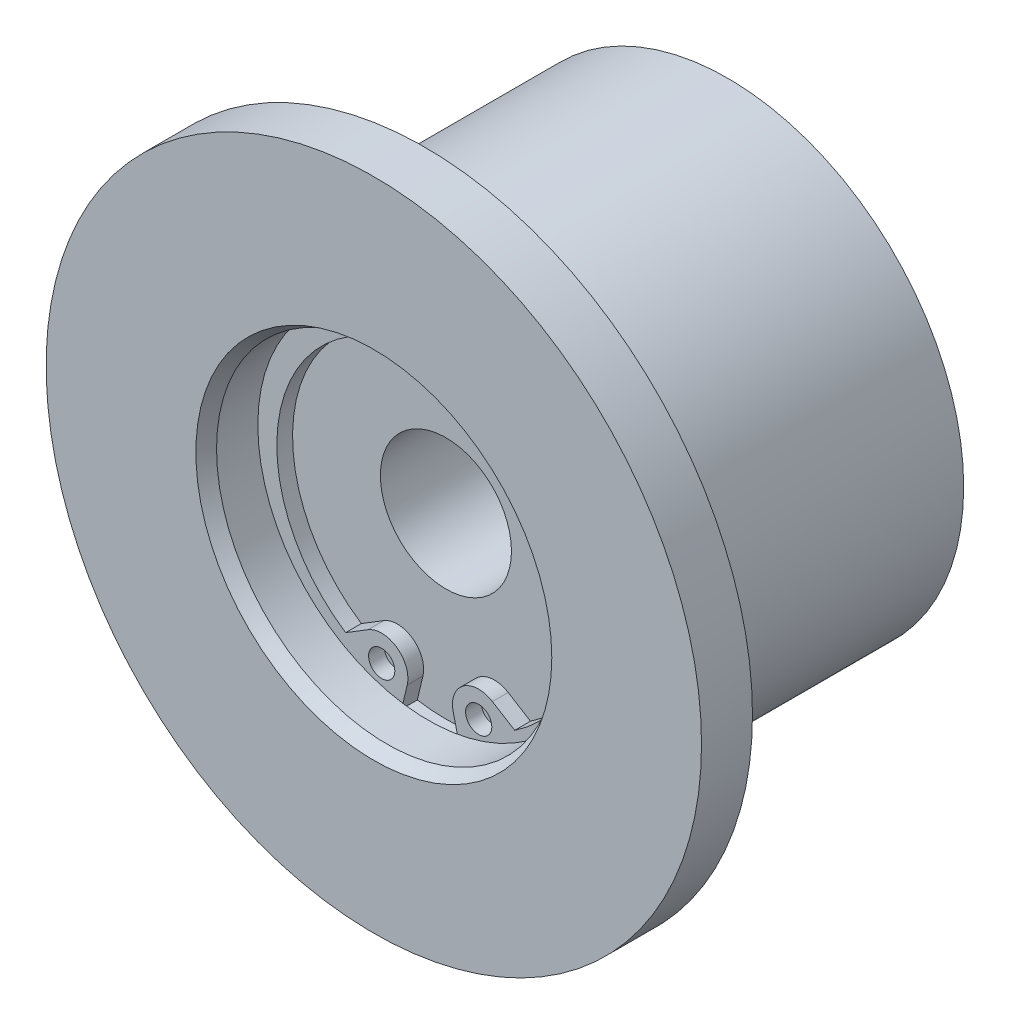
ISO-10303-21;
HEADER;
FILE_DESCRIPTION(('STEP AP214'),'2;1');
FILE_NAME('part.step','',(''),(''),'','','');
FILE_SCHEMA(('AUTOMOTIVE_DESIGN { 1 0 10303 214 1 1 1 1 }'));
ENDSEC;
DATA;
#1=APPLICATION_CONTEXT('core data for automotive mechanical design processes');
#2=APPLICATION_PROTOCOL_DEFINITION('international standard','automotive_design',2000,#1);
#3=PRODUCT_CONTEXT('',#1,'mechanical');
#4=PRODUCT('Part','Part','',(#3));
#5=PRODUCT_RELATED_PRODUCT_CATEGORY('part','',(#4));
#6=PRODUCT_DEFINITION_FORMATION('','',#4);
#7=PRODUCT_DEFINITION_CONTEXT('part definition',#1,'design');
#8=PRODUCT_DEFINITION('design','',#6,#7);
#9=PRODUCT_DEFINITION_SHAPE('','',#8);
#10=(LENGTH_UNIT() NAMED_UNIT(*) SI_UNIT(.MILLI.,.METRE.));
#11=(NAMED_UNIT(*) PLANE_ANGLE_UNIT() SI_UNIT($,.RADIAN.));
#12=(NAMED_UNIT(*) SI_UNIT($,.STERADIAN.) SOLID_ANGLE_UNIT());
#13=UNCERTAINTY_MEASURE_WITH_UNIT(LENGTH_MEASURE(1.E-05),#10,'distance_accuracy_value','');
#14=(GEOMETRIC_REPRESENTATION_CONTEXT(3) GLOBAL_UNCERTAINTY_ASSIGNED_CONTEXT((#13)) GLOBAL_UNIT_ASSIGNED_CONTEXT((#10,
#11,#12)) REPRESENTATION_CONTEXT('',''));
#15=CARTESIAN_POINT('',(0.,0.,0.));
#16=DIRECTION('',(0.,0.,1.));
#17=DIRECTION('',(1.,0.,0.));
#18=AXIS2_PLACEMENT_3D('',#15,#16,#17);
#19=CARTESIAN_POINT('',(0.,5.,8.));
#20=DIRECTION('',(0.,0.,-1.));
#21=DIRECTION('',(-1.,0.,0.));
#22=AXIS2_PLACEMENT_3D('',#19,#20,#21);
#23=PLANE('',#22);
#24=CARTESIAN_POINT('',(3.7,-11.165302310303,8.));
#25=DIRECTION('',(0.,0.,-1.));
#26=DIRECTION('',(-1.,0.,0.));
#27=AXIS2_PLACEMENT_3D('',#24,#25,#26);
#28=CIRCLE('',#27,1.);
#29=CARTESIAN_POINT('',(2.7,-11.165302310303,8.));
#30=VERTEX_POINT('',#29);
#31=EDGE_CURVE('E510',#30,#30,#28,.T.);
#32=ORIENTED_EDGE('',*,*,#31,.F.);
#33=EDGE_LOOP('',(#32));
#34=FACE_BOUND('',#33,.T.);
#35=ADVANCED_FACE('F14',(#34),#23,.F.);
#36=CARTESIAN_POINT('',(-3.7,-11.165302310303,8.));
#37=DIRECTION('',(0.,0.,-1.));
#38=DIRECTION('',(-1.,0.,0.));
#39=AXIS2_PLACEMENT_3D('',#36,#37,#38);
#40=CIRCLE('',#39,1.);
#41=CARTESIAN_POINT('',(-4.7,-11.165302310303,8.));
#42=VERTEX_POINT('',#41);
#43=EDGE_CURVE('E513',#42,#42,#40,.T.);
#44=ORIENTED_EDGE('',*,*,#43,.F.);
#45=EDGE_LOOP('',(#44));
#46=FACE_BOUND('',#45,.T.);
#47=ADVANCED_FACE('F298',(#46),#23,.F.);
#48=CARTESIAN_POINT('',(0.,0.,9.));
#49=DIRECTION('',(0.,0.,1.));
#50=DIRECTION('',(1.,0.,0.));
#51=AXIS2_PLACEMENT_3D('',#48,#49,#50);
#52=CONICAL_SURFACE('',#51,18.,1.48352986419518);
#53=CARTESIAN_POINT('',(0.,0.,9.61242064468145));
#54=DIRECTION('',(0.,0.,1.));
#55=DIRECTION('',(1.,0.,0.));
#56=AXIS2_PLACEMENT_3D('',#53,#54,#55);
#57=CIRCLE('',#56,25.);
#58=CARTESIAN_POINT('',(25.,0.,9.61242064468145));
#59=VERTEX_POINT('',#58);
#60=EDGE_CURVE('E504',#59,#59,#57,.T.);
#61=ORIENTED_EDGE('',*,*,#60,.F.);
#62=EDGE_LOOP('',(#61));
#63=FACE_BOUND('',#62,.T.);
#64=CARTESIAN_POINT('',(0.,0.,9.));
#65=DIRECTION('',(0.,0.,1.));
#66=DIRECTION('',(1.,0.,0.));
#67=AXIS2_PLACEMENT_3D('',#64,#65,#66);
#68=CIRCLE('',#67,18.);
#69=CARTESIAN_POINT('',(18.,0.,9.));
#70=VERTEX_POINT('',#69);
#71=EDGE_CURVE('E507',#70,#70,#68,.T.);
#72=ORIENTED_EDGE('',*,*,#71,.T.);
#73=EDGE_LOOP('',(#72));
#74=FACE_BOUND('',#73,.T.);
#75=ADVANCED_FACE('F317',(#63,#74),#52,.T.);
#76=CARTESIAN_POINT('',(0.,0.,18.1183293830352));
#77=DIRECTION('',(0.,0.,1.));
#78=DIRECTION('',(1.,0.,0.));
#79=AXIS2_PLACEMENT_3D('',#76,#77,#78);
#80=CYLINDRICAL_SURFACE('',#79,25.);
#81=CARTESIAN_POINT('',(0.,0.,13.5));
#82=DIRECTION('',(0.,0.,1.));
#83=DIRECTION('',(1.,0.,0.));
#84=AXIS2_PLACEMENT_3D('',#81,#82,#83);
#85=CIRCLE('',#84,25.);
#86=CARTESIAN_POINT('',(25.,0.,13.5));
#87=VERTEX_POINT('',#86);
#88=EDGE_CURVE('E501',#87,#87,#85,.T.);
#89=ORIENTED_EDGE('',*,*,#88,.F.);
#90=EDGE_LOOP('',(#89));
#91=FACE_BOUND('',#90,.T.);
#92=ORIENTED_EDGE('',*,*,#60,.T.);
#93=EDGE_LOOP('',(#92));
#94=FACE_BOUND('',#93,.T.);
#95=ADVANCED_FACE('F335',(#91,#94),#80,.T.);
#96=CARTESIAN_POINT('',(0.,0.,18.1183293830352));
#97=DIRECTION('',(0.,0.,1.));
#98=DIRECTION('',(1.,0.,0.));
#99=AXIS2_PLACEMENT_3D('',#96,#97,#98);
#100=CYLINDRICAL_SURFACE('',#99,18.);
#101=ORIENTED_EDGE('',*,*,#71,.F.);
#102=EDGE_LOOP('',(#101));
#103=FACE_BOUND('',#102,.T.);
#104=CARTESIAN_POINT('',(0.,0.,-13.5));
#105=DIRECTION('',(0.,0.,1.));
#106=DIRECTION('',(1.,0.,0.));
#107=AXIS2_PLACEMENT_3D('',#104,#105,#106);
#108=CIRCLE('',#107,18.);
#109=CARTESIAN_POINT('',(18.,0.,-13.5));
#110=VERTEX_POINT('',#109);
#111=EDGE_CURVE('E107',#110,#110,#108,.T.);
#112=ORIENTED_EDGE('',*,*,#111,.T.);
#113=EDGE_LOOP('',(#112));
#114=FACE_BOUND('',#113,.T.);
#115=ADVANCED_FACE('F329',(#103,#114),#100,.T.);
#116=CARTESIAN_POINT('',(0.,25.,13.5));
#117=DIRECTION('',(0.,0.,-1.));
#118=DIRECTION('',(-1.,0.,0.));
#119=AXIS2_PLACEMENT_3D('',#116,#117,#118);
#120=PLANE('',#119);
#121=CARTESIAN_POINT('',(0.,0.,13.5));
#122=DIRECTION('',(0.,0.,1.));
#123=DIRECTION('',(1.,0.,0.));
#124=AXIS2_PLACEMENT_3D('',#121,#122,#123);
#125=CIRCLE('',#124,13.5773502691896);
#126=CARTESIAN_POINT('',(13.5773502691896,0.,13.5));
#127=VERTEX_POINT('',#126);
#128=EDGE_CURVE('E498',#127,#127,#125,.T.);
#129=ORIENTED_EDGE('',*,*,#128,.F.);
#130=EDGE_LOOP('',(#129));
#131=FACE_BOUND('',#130,.T.);
#132=ORIENTED_EDGE('',*,*,#88,.T.);
#133=EDGE_LOOP('',(#132));
#134=FACE_BOUND('',#133,.T.);
#135=ADVANCED_FACE('F334',(#131,#134),#120,.F.);
#136=CARTESIAN_POINT('',(0.,11.,-13.5));
#137=DIRECTION('',(0.,0.,1.));
#138=DIRECTION('',(1.,0.,0.));
#139=AXIS2_PLACEMENT_3D('',#136,#137,#138);
#140=PLANE('',#139);
#141=ORIENTED_EDGE('',*,*,#111,.F.);
#142=EDGE_LOOP('',(#141));
#143=FACE_BOUND('',#142,.T.);
#144=CARTESIAN_POINT('',(0.,0.,-13.5));
#145=DIRECTION('',(0.,0.,1.));
#146=DIRECTION('',(1.,0.,0.));
#147=AXIS2_PLACEMENT_3D('',#144,#145,#146);
#148=CIRCLE('',#147,11.);
#149=CARTESIAN_POINT('',(11.,0.,-13.5));
#150=VERTEX_POINT('',#149);
#151=EDGE_CURVE('E473',#150,#150,#148,.T.);
#152=ORIENTED_EDGE('',*,*,#151,.T.);
#153=EDGE_LOOP('',(#152));
#154=FACE_BOUND('',#153,.T.);
#155=ADVANCED_FACE('F359',(#143,#154),#140,.F.);
#156=CARTESIAN_POINT('',(0.,0.,13.5));
#157=DIRECTION('',(0.,0.,1.));
#158=DIRECTION('',(1.,0.,0.));
#159=AXIS2_PLACEMENT_3D('',#156,#157,#158);
#160=CONICAL_SURFACE('',#159,13.5773502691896,0.523598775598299);
#161=CARTESIAN_POINT('',(0.,0.,12.5));
#162=DIRECTION('',(0.,0.,1.));
#163=DIRECTION('',(1.,0.,0.));
#164=AXIS2_PLACEMENT_3D('',#161,#162,#163);
#165=CIRCLE('',#164,13.);
#166=CARTESIAN_POINT('',(13.,0.,12.5));
#167=VERTEX_POINT('',#166);
#168=EDGE_CURVE('E495',#167,#167,#165,.T.);
#169=ORIENTED_EDGE('',*,*,#168,.F.);
#170=EDGE_LOOP('',(#169));
#171=FACE_BOUND('',#170,.T.);
#172=ORIENTED_EDGE('',*,*,#128,.T.);
#173=EDGE_LOOP('',(#172));
#174=FACE_BOUND('',#173,.T.);
#175=ADVANCED_FACE('F365',(#171,#174),#160,.F.);
#176=CARTESIAN_POINT('',(0.,0.,18.1183293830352));
#177=DIRECTION('',(0.,0.,1.));
#178=DIRECTION('',(1.,0.,0.));
#179=AXIS2_PLACEMENT_3D('',#176,#177,#178);
#180=CYLINDRICAL_SURFACE('',#179,11.);
#181=ORIENTED_EDGE('',*,*,#151,.F.);
#182=EDGE_LOOP('',(#181));
#183=FACE_BOUND('',#182,.T.);
#184=CARTESIAN_POINT('',(0.,0.,-8.));
#185=DIRECTION('',(0.,0.,1.));
#186=DIRECTION('',(1.,0.,0.));
#187=AXIS2_PLACEMENT_3D('',#184,#185,#186);
#188=CIRCLE('',#187,11.);
#189=CARTESIAN_POINT('',(11.,0.,-8.));
#190=VERTEX_POINT('',#189);
#191=EDGE_CURVE('E474',#190,#190,#188,.T.);
#192=ORIENTED_EDGE('',*,*,#191,.T.);
#193=EDGE_LOOP('',(#192));
#194=FACE_BOUND('',#193,.T.);
#195=ADVANCED_FACE('F370',(#183,#194),#180,.F.);
#196=CARTESIAN_POINT('',(0.,0.,18.1183293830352));
#197=DIRECTION('',(0.,0.,1.));
#198=DIRECTION('',(1.,0.,0.));
#199=AXIS2_PLACEMENT_3D('',#196,#197,#198);
#200=CYLINDRICAL_SURFACE('',#199,13.);
#201=CARTESIAN_POINT('',(0.,0.,9.35));
#202=DIRECTION('',(0.,0.,1.));
#203=DIRECTION('',(1.,0.,0.));
#204=AXIS2_PLACEMENT_3D('',#201,#202,#203);
#205=CIRCLE('',#204,13.);
#206=CARTESIAN_POINT('',(13.,0.,9.35));
#207=VERTEX_POINT('',#206);
#208=EDGE_CURVE('E492',#207,#207,#205,.T.);
#209=ORIENTED_EDGE('',*,*,#208,.F.);
#210=EDGE_LOOP('',(#209));
#211=FACE_BOUND('',#210,.T.);
#212=ORIENTED_EDGE('',*,*,#168,.T.);
#213=EDGE_LOOP('',(#212));
#214=FACE_BOUND('',#213,.T.);
#215=ADVANCED_FACE('F376',(#211,#214),#200,.F.);
#216=CARTESIAN_POINT('',(0.,11.,-8.));
#217=DIRECTION('',(0.,0.,1.));
#218=DIRECTION('',(1.,0.,0.));
#219=AXIS2_PLACEMENT_3D('',#216,#217,#218);
#220=PLANE('',#219);
#221=ORIENTED_EDGE('',*,*,#191,.F.);
#222=EDGE_LOOP('',(#221));
#223=FACE_BOUND('',#222,.T.);
#224=CARTESIAN_POINT('',(0.,0.,-8.));
#225=DIRECTION('',(0.,0.,1.));
#226=DIRECTION('',(1.,0.,0.));
#227=AXIS2_PLACEMENT_3D('',#224,#225,#226);
#228=CIRCLE('',#227,5.);
#229=CARTESIAN_POINT('',(5.,0.,-8.));
#230=VERTEX_POINT('',#229);
#231=EDGE_CURVE('E477',#230,#230,#228,.T.);
#232=ORIENTED_EDGE('',*,*,#231,.T.);
#233=EDGE_LOOP('',(#232));
#234=FACE_BOUND('',#233,.T.);
#235=ADVANCED_FACE('F381',(#223,#234),#220,.F.);
#236=CARTESIAN_POINT('',(0.,13.6,9.35));
#237=DIRECTION('',(0.,0.,1.));
#238=DIRECTION('',(1.,0.,0.));
#239=AXIS2_PLACEMENT_3D('',#236,#237,#238);
#240=PLANE('',#239);
#241=CARTESIAN_POINT('',(0.,0.,9.35));
#242=DIRECTION('',(0.,0.,1.));
#243=DIRECTION('',(1.,0.,0.));
#244=AXIS2_PLACEMENT_3D('',#241,#242,#243);
#245=CIRCLE('',#244,13.6);
#246=CARTESIAN_POINT('',(13.6,0.,9.35));
#247=VERTEX_POINT('',#246);
#248=EDGE_CURVE('E489',#247,#247,#245,.T.);
#249=ORIENTED_EDGE('',*,*,#248,.F.);
#250=EDGE_LOOP('',(#249));
#251=FACE_BOUND('',#250,.T.);
#252=ORIENTED_EDGE('',*,*,#208,.T.);
#253=EDGE_LOOP('',(#252));
#254=FACE_BOUND('',#253,.T.);
#255=ADVANCED_FACE('F307',(#251,#254),#240,.F.);
#256=CARTESIAN_POINT('',(0.,0.,18.1183293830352));
#257=DIRECTION('',(0.,0.,1.));
#258=DIRECTION('',(1.,0.,0.));
#259=AXIS2_PLACEMENT_3D('',#256,#257,#258);
#260=CYLINDRICAL_SURFACE('',#259,13.6);
#261=ORIENTED_EDGE('',*,*,#248,.T.);
#262=EDGE_LOOP('',(#261));
#263=FACE_BOUND('',#262,.T.);
#264=DIRECTION('',(0.,0.,1.));
#265=VECTOR('',#264,1.);
#266=CARTESIAN_POINT('',(2.1813307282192,-13.4239262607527,18.1183293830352));
#267=LINE('',#266,#265);
#268=CARTESIAN_POINT('',(2.1813307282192,-13.4239262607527,8.));
#269=VERTEX_POINT('',#268);
#270=CARTESIAN_POINT('',(2.1813307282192,-13.4239262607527,9.2));
#271=VERTEX_POINT('',#270);
#272=EDGE_CURVE('E9',#269,#271,#267,.T.);
#273=ORIENTED_EDGE('',*,*,#272,.F.);
#274=CARTESIAN_POINT('',(0.,0.,8.));
#275=DIRECTION('',(0.,0.,1.));
#276=DIRECTION('',(1.,0.,0.));
#277=AXIS2_PLACEMENT_3D('',#274,#275,#276);
#278=CIRCLE('',#277,13.6);
#279=CARTESIAN_POINT('',(-2.18133072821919,-13.4239262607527,8.));
#280=VERTEX_POINT('',#279);
#281=EDGE_CURVE('E486',#280,#269,#278,.T.);
#282=ORIENTED_EDGE('',*,*,#281,.F.);
#283=DIRECTION('',(0.,0.,1.));
#284=VECTOR('',#283,1.);
#285=CARTESIAN_POINT('',(-2.18133072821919,-13.4239262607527,18.1183293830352));
#286=LINE('',#285,#284);
#287=CARTESIAN_POINT('',(-2.18133072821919,-13.4239262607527,9.2));
#288=VERTEX_POINT('',#287);
#289=EDGE_CURVE('E109',#288,#280,#286,.F.);
#290=ORIENTED_EDGE('',*,*,#289,.F.);
#291=CARTESIAN_POINT('',(0.,0.,9.2));
#292=DIRECTION('',(0.,0.,-1.));
#293=DIRECTION('',(-1.,0.,0.));
#294=AXIS2_PLACEMENT_3D('',#291,#292,#293);
#295=CIRCLE('',#294,13.6);
#296=EDGE_CURVE('E23',#271,#288,#295,.F.);
#297=ORIENTED_EDGE('',*,*,#296,.F.);
#298=EDGE_LOOP('',(#273,#282,#290,#297));
#299=FACE_BOUND('',#298,.T.);
#300=ADVANCED_FACE('F302',(#263,#299),#260,.F.);
#301=CARTESIAN_POINT('',(0.,0.,18.1183293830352));
#302=DIRECTION('',(0.,0.,1.));
#303=DIRECTION('',(1.,0.,0.));
#304=AXIS2_PLACEMENT_3D('',#301,#302,#303);
#305=CYLINDRICAL_SURFACE('',#304,5.);
#306=ORIENTED_EDGE('',*,*,#231,.F.);
#307=EDGE_LOOP('',(#306));
#308=FACE_BOUND('',#307,.T.);
#309=CARTESIAN_POINT('',(0.,0.,8.));
#310=DIRECTION('',(0.,0.,1.));
#311=DIRECTION('',(1.,0.,0.));
#312=AXIS2_PLACEMENT_3D('',#309,#310,#311);
#313=CIRCLE('',#312,5.);
#314=CARTESIAN_POINT('',(5.,0.,8.));
#315=VERTEX_POINT('',#314);
#316=EDGE_CURVE('E483',#315,#315,#313,.T.);
#317=ORIENTED_EDGE('',*,*,#316,.T.);
#318=EDGE_LOOP('',(#317));
#319=FACE_BOUND('',#318,.T.);
#320=ADVANCED_FACE('F295',(#308,#319),#305,.F.);
#321=ORIENTED_EDGE('',*,*,#316,.F.);
#322=EDGE_LOOP('',(#321));
#323=FACE_BOUND('',#322,.T.);
#324=DIRECTION('',(0.231349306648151,-0.972870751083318,0.));
#325=VECTOR('',#324,1.);
#326=CARTESIAN_POINT('',(-2.08214742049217,4.50486396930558,8.));
#327=LINE('',#326,#325);
#328=CARTESIAN_POINT('',(1.75425849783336,-11.6280009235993,8.));
#329=VERTEX_POINT('',#328);
#330=EDGE_CURVE('E111',#329,#269,#327,.T.);
#331=ORIENTED_EDGE('',*,*,#330,.F.);
#332=CARTESIAN_POINT('',(3.7,-11.165302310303,8.));
#333=DIRECTION('',(0.,0.,-1.));
#334=DIRECTION('',(-1.,0.,0.));
#335=AXIS2_PLACEMENT_3D('',#332,#333,#334);
#336=CIRCLE('',#335,2.);
#337=CARTESIAN_POINT('',(4.74866968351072,-9.46227797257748,8.));
#338=VERTEX_POINT('',#337);
#339=EDGE_CURVE('E89',#329,#338,#336,.T.);
#340=ORIENTED_EDGE('',*,*,#339,.T.);
#341=DIRECTION('',(-0.851512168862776,0.524334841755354,0.));
#342=VECTOR('',#341,1.);
#343=CARTESIAN_POINT('',(-5.1515440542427,-3.36603273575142,8.));
#344=LINE('',#343,#342);
#345=CARTESIAN_POINT('',(6.45127454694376,-10.5106893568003,8.));
#346=VERTEX_POINT('',#345);
#347=EDGE_CURVE('E124',#346,#338,#344,.T.);
#348=ORIENTED_EDGE('',*,*,#347,.F.);
#349=CARTESIAN_POINT('',(0.,-0.75,8.));
#350=DIRECTION('',(0.,0.,-1.));
#351=DIRECTION('',(-1.,0.,0.));
#352=AXIS2_PLACEMENT_3D('',#349,#350,#351);
#353=CIRCLE('',#352,11.7);
#354=CARTESIAN_POINT('',(-6.45127454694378,-10.5106893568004,8.));
#355=VERTEX_POINT('',#354);
#356=EDGE_CURVE('E528',#355,#346,#353,.T.);
#357=ORIENTED_EDGE('',*,*,#356,.F.);
#358=DIRECTION('',(-0.851512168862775,-0.524334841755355,0.));
#359=VECTOR('',#358,1.);
#360=CARTESIAN_POINT('',(5.1515440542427,-3.3660327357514,8.));
#361=LINE('',#360,#359);
#362=CARTESIAN_POINT('',(-4.74866968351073,-9.46227797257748,8.));
#363=VERTEX_POINT('',#362);
#364=EDGE_CURVE('E524',#363,#355,#361,.T.);
#365=ORIENTED_EDGE('',*,*,#364,.F.);
#366=CARTESIAN_POINT('',(-3.7,-11.165302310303,8.));
#367=DIRECTION('',(0.,0.,-1.));
#368=DIRECTION('',(-1.,0.,0.));
#369=AXIS2_PLACEMENT_3D('',#366,#367,#368);
#370=CIRCLE('',#369,2.);
#371=CARTESIAN_POINT('',(-1.75425849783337,-11.6280009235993,8.));
#372=VERTEX_POINT('',#371);
#373=EDGE_CURVE('E517',#363,#372,#370,.T.);
#374=ORIENTED_EDGE('',*,*,#373,.T.);
#375=DIRECTION('',(0.231349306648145,0.97287075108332,0.));
#376=VECTOR('',#375,1.);
#377=CARTESIAN_POINT('',(2.08214742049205,4.50486396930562,8.));
#378=LINE('',#377,#376);
#379=EDGE_CURVE('E521',#280,#372,#378,.T.);
#380=ORIENTED_EDGE('',*,*,#379,.F.);
#381=ORIENTED_EDGE('',*,*,#281,.T.);
#382=EDGE_LOOP('',(#331,#340,#348,#357,#365,#374,#380,#381));
#383=FACE_BOUND('',#382,.T.);
#384=ADVANCED_FACE('F217',(#323,#383),#23,.F.);
#385=CARTESIAN_POINT('',(0.,-0.75,9.2));
#386=DIRECTION('',(0.,0.,1.));
#387=DIRECTION('',(-1.,0.,0.));
#388=AXIS2_PLACEMENT_3D('',#385,#386,#387);
#389=CYLINDRICAL_SURFACE('',#388,11.7);
#390=ORIENTED_EDGE('',*,*,#356,.T.);
#391=DIRECTION('',(0.,0.,-1.));
#392=VECTOR('',#391,1.);
#393=CARTESIAN_POINT('',(6.45127454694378,-10.5106893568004,9.2));
#394=LINE('',#393,#392);
#395=CARTESIAN_POINT('',(6.45127454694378,-10.5106893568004,9.2));
#396=VERTEX_POINT('',#395);
#397=EDGE_CURVE('E128',#396,#346,#394,.T.);
#398=ORIENTED_EDGE('',*,*,#397,.F.);
#399=CARTESIAN_POINT('',(0.,-0.75,9.2));
#400=DIRECTION('',(0.,0.,-1.));
#401=DIRECTION('',(0.,-1.,0.));
#402=AXIS2_PLACEMENT_3D('',#399,#400,#401);
#403=CIRCLE('',#402,11.7);
#404=CARTESIAN_POINT('',(-6.45127454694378,-10.5106893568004,9.2));
#405=VERTEX_POINT('',#404);
#406=EDGE_CURVE('E136',#405,#396,#403,.T.);
#407=ORIENTED_EDGE('',*,*,#406,.F.);
#408=DIRECTION('',(0.,0.,-1.));
#409=VECTOR('',#408,1.);
#410=CARTESIAN_POINT('',(-6.45127454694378,-10.5106893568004,9.2));
#411=LINE('',#410,#409);
#412=EDGE_CURVE('E108',#405,#355,#411,.T.);
#413=ORIENTED_EDGE('',*,*,#412,.T.);
#414=EDGE_LOOP('',(#390,#398,#407,#413));
#415=FACE_BOUND('',#414,.T.);
#416=ADVANCED_FACE('F16',(#415),#389,.F.);
#417=CARTESIAN_POINT('',(4.74866968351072,-9.46227797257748,9.2));
#418=DIRECTION('',(-0.524334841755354,-0.851512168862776,0.));
#419=DIRECTION('',(-0.851512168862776,0.524334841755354,0.));
#420=AXIS2_PLACEMENT_3D('',#417,#418,#419);
#421=PLANE('',#420);
#422=ORIENTED_EDGE('',*,*,#347,.T.);
#423=DIRECTION('',(0.,0.,-1.));
#424=VECTOR('',#423,1.);
#425=CARTESIAN_POINT('',(4.74866968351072,-9.46227797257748,9.2));
#426=LINE('',#425,#424);
#427=CARTESIAN_POINT('',(4.74866968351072,-9.46227797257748,9.2));
#428=VERTEX_POINT('',#427);
#429=EDGE_CURVE('E91',#428,#338,#426,.T.);
#430=ORIENTED_EDGE('',*,*,#429,.F.);
#431=DIRECTION('',(-0.851512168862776,0.524334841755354,0.));
#432=VECTOR('',#431,1.);
#433=CARTESIAN_POINT('',(4.74866968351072,-9.46227797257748,9.2));
#434=LINE('',#433,#432);
#435=EDGE_CURVE('E81',#396,#428,#434,.T.);
#436=ORIENTED_EDGE('',*,*,#435,.F.);
#437=ORIENTED_EDGE('',*,*,#397,.T.);
#438=EDGE_LOOP('',(#422,#430,#436,#437));
#439=FACE_BOUND('',#438,.T.);
#440=ADVANCED_FACE('F201',(#439),#421,.F.);
#441=CARTESIAN_POINT('',(3.7,-11.165302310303,9.2));
#442=DIRECTION('',(0.,0.,1.));
#443=DIRECTION('',(-1.,0.,0.));
#444=AXIS2_PLACEMENT_3D('',#441,#442,#443);
#445=CYLINDRICAL_SURFACE('',#444,2.);
#446=ORIENTED_EDGE('',*,*,#339,.F.);
#447=DIRECTION('',(0.,0.,-1.));
#448=VECTOR('',#447,1.);
#449=CARTESIAN_POINT('',(1.75425849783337,-11.6280009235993,9.2));
#450=LINE('',#449,#448);
#451=CARTESIAN_POINT('',(1.75425849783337,-11.6280009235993,9.2));
#452=VERTEX_POINT('',#451);
#453=EDGE_CURVE('E73',#452,#329,#450,.T.);
#454=ORIENTED_EDGE('',*,*,#453,.F.);
#455=CARTESIAN_POINT('',(3.7,-11.165302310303,9.2));
#456=DIRECTION('',(0.,0.,1.));
#457=DIRECTION('',(1.,0.,0.));
#458=AXIS2_PLACEMENT_3D('',#455,#456,#457);
#459=CIRCLE('',#458,2.);
#460=EDGE_CURVE('E75',#428,#452,#459,.T.);
#461=ORIENTED_EDGE('',*,*,#460,.F.);
#462=ORIENTED_EDGE('',*,*,#429,.T.);
#463=EDGE_LOOP('',(#446,#454,#461,#462));
#464=FACE_BOUND('',#463,.T.);
#465=ADVANCED_FACE('F87',(#464),#445,.T.);
#466=CARTESIAN_POINT('',(-1.75425849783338,-11.6280009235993,9.2));
#467=DIRECTION('',(-0.97287075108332,0.231349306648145,0.));
#468=DIRECTION('',(0.,0.,1.));
#469=AXIS2_PLACEMENT_3D('',#466,#467,#468);
#470=PLANE('',#469);
#471=DIRECTION('',(0.231349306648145,0.97287075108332,0.));
#472=VECTOR('',#471,1.);
#473=CARTESIAN_POINT('',(-1.75425849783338,-11.6280009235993,9.2));
#474=LINE('',#473,#472);
#475=CARTESIAN_POINT('',(-1.75425849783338,-11.6280009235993,9.2));
#476=VERTEX_POINT('',#475);
#477=EDGE_CURVE('E61',#288,#476,#474,.T.);
#478=ORIENTED_EDGE('',*,*,#477,.F.);
#479=ORIENTED_EDGE('',*,*,#289,.T.);
#480=ORIENTED_EDGE('',*,*,#379,.T.);
#481=DIRECTION('',(0.,0.,-1.));
#482=VECTOR('',#481,1.);
#483=CARTESIAN_POINT('',(-1.75425849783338,-11.6280009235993,9.2));
#484=LINE('',#483,#482);
#485=EDGE_CURVE('E92',#476,#372,#484,.T.);
#486=ORIENTED_EDGE('',*,*,#485,.F.);
#487=EDGE_LOOP('',(#478,#479,#480,#486));
#488=FACE_BOUND('',#487,.T.);
#489=ADVANCED_FACE('F200',(#488),#470,.F.);
#490=CARTESIAN_POINT('',(0.,-0.75,9.2));
#491=DIRECTION('',(0.,0.,-1.));
#492=DIRECTION('',(0.,-1.,0.));
#493=AXIS2_PLACEMENT_3D('',#490,#491,#492);
#494=PLANE('',#493);
#495=CARTESIAN_POINT('',(-3.7,-11.165302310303,9.2));
#496=DIRECTION('',(0.,0.,-1.));
#497=DIRECTION('',(1.,0.,0.));
#498=AXIS2_PLACEMENT_3D('',#495,#496,#497);
#499=CIRCLE('',#498,1.);
#500=CARTESIAN_POINT('',(-2.7,-11.165302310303,9.2));
#501=VERTEX_POINT('',#500);
#502=EDGE_CURVE('E97',#501,#501,#499,.T.);
#503=ORIENTED_EDGE('',*,*,#502,.T.);
#504=EDGE_LOOP('',(#503));
#505=FACE_BOUND('',#504,.T.);
#506=CARTESIAN_POINT('',(3.7,-11.165302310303,9.2));
#507=DIRECTION('',(0.,0.,1.));
#508=DIRECTION('',(1.,0.,0.));
#509=AXIS2_PLACEMENT_3D('',#506,#507,#508);
#510=CIRCLE('',#509,1.);
#511=CARTESIAN_POINT('',(4.7,-11.165302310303,9.2));
#512=VERTEX_POINT('',#511);
#513=EDGE_CURVE('E100',#512,#512,#510,.T.);
#514=ORIENTED_EDGE('',*,*,#513,.F.);
#515=EDGE_LOOP('',(#514));
#516=FACE_BOUND('',#515,.T.);
#517=DIRECTION('',(0.231349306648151,-0.972870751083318,0.));
#518=VECTOR('',#517,1.);
#519=CARTESIAN_POINT('',(1.75425849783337,-11.6280009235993,9.2));
#520=LINE('',#519,#518);
#521=EDGE_CURVE('E68',#452,#271,#520,.T.);
#522=ORIENTED_EDGE('',*,*,#521,.T.);
#523=ORIENTED_EDGE('',*,*,#296,.T.);
#524=ORIENTED_EDGE('',*,*,#477,.T.);
#525=CARTESIAN_POINT('',(-3.7,-11.165302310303,9.2));
#526=DIRECTION('',(0.,0.,1.));
#527=DIRECTION('',(-1.,0.,0.));
#528=AXIS2_PLACEMENT_3D('',#525,#526,#527);
#529=CIRCLE('',#528,2.);
#530=CARTESIAN_POINT('',(-4.74866968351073,-9.46227797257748,9.2));
#531=VERTEX_POINT('',#530);
#532=EDGE_CURVE('E133',#476,#531,#529,.T.);
#533=ORIENTED_EDGE('',*,*,#532,.T.);
#534=DIRECTION('',(-0.851512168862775,-0.524334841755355,0.));
#535=VECTOR('',#534,1.);
#536=CARTESIAN_POINT('',(-4.74866968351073,-9.46227797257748,9.2));
#537=LINE('',#536,#535);
#538=EDGE_CURVE('E131',#531,#405,#537,.T.);
#539=ORIENTED_EDGE('',*,*,#538,.T.);
#540=ORIENTED_EDGE('',*,*,#406,.T.);
#541=ORIENTED_EDGE('',*,*,#435,.T.);
#542=ORIENTED_EDGE('',*,*,#460,.T.);
#543=EDGE_LOOP('',(#522,#523,#524,#533,#539,#540,#541,#542));
#544=FACE_BOUND('',#543,.T.);
#545=ADVANCED_FACE('F79',(#505,#516,#544),#494,.F.);
#546=CARTESIAN_POINT('',(3.7,-11.165302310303,9.2));
#547=DIRECTION('',(0.,0.,1.));
#548=DIRECTION('',(-1.,0.,0.));
#549=AXIS2_PLACEMENT_3D('',#546,#547,#548);
#550=CYLINDRICAL_SURFACE('',#549,1.);
#551=ORIENTED_EDGE('',*,*,#31,.T.);
#552=EDGE_LOOP('',(#551));
#553=FACE_BOUND('',#552,.T.);
#554=ORIENTED_EDGE('',*,*,#513,.T.);
#555=EDGE_LOOP('',(#554));
#556=FACE_BOUND('',#555,.T.);
#557=ADVANCED_FACE('F167',(#553,#556),#550,.F.);
#558=CARTESIAN_POINT('',(-3.7,-11.165302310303,9.2));
#559=DIRECTION('',(0.,0.,1.));
#560=DIRECTION('',(-1.,0.,0.));
#561=AXIS2_PLACEMENT_3D('',#558,#559,#560);
#562=CYLINDRICAL_SURFACE('',#561,1.);
#563=ORIENTED_EDGE('',*,*,#43,.T.);
#564=EDGE_LOOP('',(#563));
#565=FACE_BOUND('',#564,.T.);
#566=ORIENTED_EDGE('',*,*,#502,.F.);
#567=EDGE_LOOP('',(#566));
#568=FACE_BOUND('',#567,.T.);
#569=ADVANCED_FACE('F172',(#565,#568),#562,.F.);
#570=CARTESIAN_POINT('',(-4.74866968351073,-9.46227797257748,9.2));
#571=DIRECTION('',(0.524334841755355,-0.851512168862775,0.));
#572=DIRECTION('',(0.,0.,-1.));
#573=AXIS2_PLACEMENT_3D('',#570,#571,#572);
#574=PLANE('',#573);
#575=ORIENTED_EDGE('',*,*,#364,.T.);
#576=ORIENTED_EDGE('',*,*,#412,.F.);
#577=ORIENTED_EDGE('',*,*,#538,.F.);
#578=DIRECTION('',(0.,0.,-1.));
#579=VECTOR('',#578,1.);
#580=CARTESIAN_POINT('',(-4.74866968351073,-9.46227797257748,9.2));
#581=LINE('',#580,#579);
#582=EDGE_CURVE('E104',#531,#363,#581,.T.);
#583=ORIENTED_EDGE('',*,*,#582,.T.);
#584=EDGE_LOOP('',(#575,#576,#577,#583));
#585=FACE_BOUND('',#584,.T.);
#586=ADVANCED_FACE('F182',(#585),#574,.F.);
#587=CARTESIAN_POINT('',(-3.7,-11.165302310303,9.2));
#588=DIRECTION('',(0.,0.,1.));
#589=DIRECTION('',(-1.,0.,0.));
#590=AXIS2_PLACEMENT_3D('',#587,#588,#589);
#591=CYLINDRICAL_SURFACE('',#590,2.);
#592=ORIENTED_EDGE('',*,*,#373,.F.);
#593=ORIENTED_EDGE('',*,*,#582,.F.);
#594=ORIENTED_EDGE('',*,*,#532,.F.);
#595=ORIENTED_EDGE('',*,*,#485,.T.);
#596=EDGE_LOOP('',(#592,#593,#594,#595));
#597=FACE_BOUND('',#596,.T.);
#598=ADVANCED_FACE('F188',(#597),#591,.T.);
#599=CARTESIAN_POINT('',(1.75425849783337,-11.6280009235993,9.2));
#600=DIRECTION('',(0.972870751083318,0.231349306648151,0.));
#601=DIRECTION('',(0.,0.,-1.));
#602=AXIS2_PLACEMENT_3D('',#599,#600,#601);
#603=PLANE('',#602);
#604=ORIENTED_EDGE('',*,*,#330,.T.);
#605=ORIENTED_EDGE('',*,*,#272,.T.);
#606=ORIENTED_EDGE('',*,*,#521,.F.);
#607=ORIENTED_EDGE('',*,*,#453,.T.);
#608=EDGE_LOOP('',(#604,#605,#606,#607));
#609=FACE_BOUND('',#608,.T.);
#610=ADVANCED_FACE('F71',(#609),#603,.F.);
#611=CLOSED_SHELL('',(#35,#47,#75,#95,#115,#135,#155,#175,#195,#215,#235,#255,#300,#320,#384,
#416,#440,#465,#489,#545,#557,#569,#586,#598,#610));
#612=MANIFOLD_SOLID_BREP('B1',#611);
#613=ADVANCED_BREP_SHAPE_REPRESENTATION('',(#18,#612),#14);
#614=SHAPE_DEFINITION_REPRESENTATION(#9,#613);
ENDSEC;
END-ISO-10303-21;
